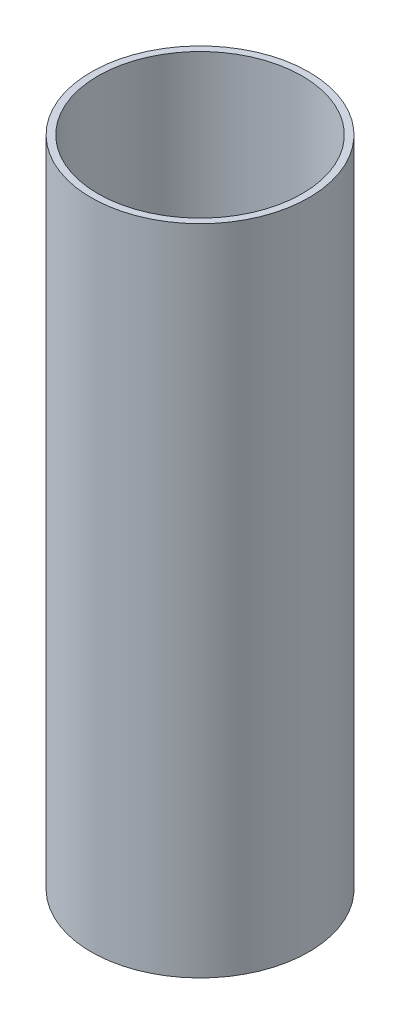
ISO-10303-21;
HEADER;
FILE_DESCRIPTION(('STEP AP214'),'2;1');
FILE_NAME('part.step','',(''),(''),'','','');
FILE_SCHEMA(('AUTOMOTIVE_DESIGN { 1 0 10303 214 1 1 1 1 }'));
ENDSEC;
DATA;
#1=APPLICATION_CONTEXT('core data for automotive mechanical design processes');
#2=APPLICATION_PROTOCOL_DEFINITION('international standard','automotive_design',2000,#1);
#3=PRODUCT_CONTEXT('',#1,'mechanical');
#4=PRODUCT('Part','Part','',(#3));
#5=PRODUCT_RELATED_PRODUCT_CATEGORY('part','',(#4));
#6=PRODUCT_DEFINITION_FORMATION('','',#4);
#7=PRODUCT_DEFINITION_CONTEXT('part definition',#1,'design');
#8=PRODUCT_DEFINITION('design','',#6,#7);
#9=PRODUCT_DEFINITION_SHAPE('','',#8);
#10=(LENGTH_UNIT() NAMED_UNIT(*) SI_UNIT(.MILLI.,.METRE.));
#11=(NAMED_UNIT(*) PLANE_ANGLE_UNIT() SI_UNIT($,.RADIAN.));
#12=(NAMED_UNIT(*) SI_UNIT($,.STERADIAN.) SOLID_ANGLE_UNIT());
#13=UNCERTAINTY_MEASURE_WITH_UNIT(LENGTH_MEASURE(1.E-05),#10,'distance_accuracy_value','');
#14=(GEOMETRIC_REPRESENTATION_CONTEXT(3) GLOBAL_UNCERTAINTY_ASSIGNED_CONTEXT((#13)) GLOBAL_UNIT_ASSIGNED_CONTEXT((#10,
#11,#12)) REPRESENTATION_CONTEXT('',''));
#15=CARTESIAN_POINT('',(0.,0.,0.));
#16=DIRECTION('',(0.,0.,1.));
#17=DIRECTION('',(1.,0.,0.));
#18=AXIS2_PLACEMENT_3D('',#15,#16,#17);
#19=CARTESIAN_POINT('',(0.,152.4,0.));
#20=DIRECTION('',(0.,1.,0.));
#21=DIRECTION('',(0.,0.,1.));
#22=AXIS2_PLACEMENT_3D('',#19,#20,#21);
#23=PLANE('',#22);
#24=CARTESIAN_POINT('',(0.,152.4,0.));
#25=DIRECTION('',(0.,1.,0.));
#26=DIRECTION('',(0.,0.,1.));
#27=AXIS2_PLACEMENT_3D('',#24,#25,#26);
#28=CIRCLE('',#27,25.4);
#29=CARTESIAN_POINT('',(0.,152.4,-25.4));
#30=VERTEX_POINT('',#29);
#31=EDGE_CURVE('E10',#30,#30,#28,.T.);
#32=ORIENTED_EDGE('',*,*,#31,.T.);
#33=EDGE_LOOP('',(#32));
#34=FACE_BOUND('',#33,.T.);
#35=CARTESIAN_POINT('',(0.,152.4,0.));
#36=DIRECTION('',(0.,1.,0.));
#37=DIRECTION('',(0.,0.,1.));
#38=AXIS2_PLACEMENT_3D('',#35,#36,#37);
#39=CIRCLE('',#38,23.8125);
#40=CARTESIAN_POINT('',(0.,152.4,-23.8125));
#41=VERTEX_POINT('',#40);
#42=EDGE_CURVE('E42',#41,#41,#39,.T.);
#43=ORIENTED_EDGE('',*,*,#42,.F.);
#44=EDGE_LOOP('',(#43));
#45=FACE_BOUND('',#44,.T.);
#46=ADVANCED_FACE('F31',(#34,#45),#23,.T.);
#47=CARTESIAN_POINT('',(0.,0.,0.));
#48=DIRECTION('',(0.,1.,0.));
#49=DIRECTION('',(0.,0.,1.));
#50=AXIS2_PLACEMENT_3D('',#47,#48,#49);
#51=PLANE('',#50);
#52=CARTESIAN_POINT('',(0.,0.,0.));
#53=DIRECTION('',(0.,1.,0.));
#54=DIRECTION('',(0.,0.,1.));
#55=AXIS2_PLACEMENT_3D('',#52,#53,#54);
#56=CIRCLE('',#55,25.4);
#57=CARTESIAN_POINT('',(0.,0.,-25.4));
#58=VERTEX_POINT('',#57);
#59=EDGE_CURVE('E35',#58,#58,#56,.T.);
#60=ORIENTED_EDGE('',*,*,#59,.F.);
#61=EDGE_LOOP('',(#60));
#62=FACE_BOUND('',#61,.T.);
#63=CARTESIAN_POINT('',(0.,0.,0.));
#64=DIRECTION('',(0.,1.,0.));
#65=DIRECTION('',(0.,0.,1.));
#66=AXIS2_PLACEMENT_3D('',#63,#64,#65);
#67=CIRCLE('',#66,23.8125);
#68=CARTESIAN_POINT('',(0.,0.,-23.8125));
#69=VERTEX_POINT('',#68);
#70=EDGE_CURVE('E44',#69,#69,#67,.T.);
#71=ORIENTED_EDGE('',*,*,#70,.T.);
#72=EDGE_LOOP('',(#71));
#73=FACE_BOUND('',#72,.T.);
#74=ADVANCED_FACE('F54',(#62,#73),#51,.F.);
#75=CARTESIAN_POINT('',(0.,152.4,0.));
#76=DIRECTION('',(0.,-1.,0.));
#77=DIRECTION('',(0.,0.,-1.));
#78=AXIS2_PLACEMENT_3D('',#75,#76,#77);
#79=CYLINDRICAL_SURFACE('',#78,25.4);
#80=CARTESIAN_POINT('',(0.,152.4,-25.4));
#81=CARTESIAN_POINT('',(0.,150.8125,-25.4));
#82=CARTESIAN_POINT('',(0.,149.225,-25.4));
#83=CARTESIAN_POINT('',(0.,146.05,-25.4));
#84=CARTESIAN_POINT('',(0.,144.4625,-25.4));
#85=CARTESIAN_POINT('',(0.,141.2875,-25.4));
#86=CARTESIAN_POINT('',(0.,139.7,-25.4));
#87=CARTESIAN_POINT('',(0.,136.525,-25.4));
#88=CARTESIAN_POINT('',(0.,134.9375,-25.4));
#89=CARTESIAN_POINT('',(0.,131.7625,-25.4));
#90=CARTESIAN_POINT('',(0.,130.175,-25.4));
#91=CARTESIAN_POINT('',(0.,127.,-25.4));
#92=CARTESIAN_POINT('',(0.,125.4125,-25.4));
#93=CARTESIAN_POINT('',(0.,122.2375,-25.4));
#94=CARTESIAN_POINT('',(0.,120.65,-25.4));
#95=CARTESIAN_POINT('',(0.,117.475,-25.4));
#96=CARTESIAN_POINT('',(0.,115.8875,-25.4));
#97=CARTESIAN_POINT('',(0.,112.7125,-25.4));
#98=CARTESIAN_POINT('',(0.,111.125,-25.4));
#99=CARTESIAN_POINT('',(0.,107.95,-25.4));
#100=CARTESIAN_POINT('',(0.,106.3625,-25.4));
#101=CARTESIAN_POINT('',(0.,103.1875,-25.4));
#102=CARTESIAN_POINT('',(0.,101.6,-25.4));
#103=CARTESIAN_POINT('',(0.,98.425,-25.4));
#104=CARTESIAN_POINT('',(0.,96.8375,-25.4));
#105=CARTESIAN_POINT('',(0.,93.6625,-25.4));
#106=CARTESIAN_POINT('',(0.,92.075,-25.4));
#107=CARTESIAN_POINT('',(0.,88.9,-25.4));
#108=CARTESIAN_POINT('',(0.,87.3125,-25.4));
#109=CARTESIAN_POINT('',(0.,84.1375,-25.4));
#110=CARTESIAN_POINT('',(0.,82.55,-25.4));
#111=CARTESIAN_POINT('',(0.,79.375,-25.4));
#112=CARTESIAN_POINT('',(0.,77.7875,-25.4));
#113=CARTESIAN_POINT('',(0.,74.6125,-25.4));
#114=CARTESIAN_POINT('',(0.,73.025,-25.4));
#115=CARTESIAN_POINT('',(0.,69.85,-25.4));
#116=CARTESIAN_POINT('',(0.,68.2625,-25.4));
#117=CARTESIAN_POINT('',(0.,65.0875,-25.4));
#118=CARTESIAN_POINT('',(0.,63.5,-25.4));
#119=CARTESIAN_POINT('',(0.,60.325,-25.4));
#120=CARTESIAN_POINT('',(0.,58.7375,-25.4));
#121=CARTESIAN_POINT('',(0.,55.5625,-25.4));
#122=CARTESIAN_POINT('',(0.,53.975,-25.4));
#123=CARTESIAN_POINT('',(0.,50.8,-25.4));
#124=CARTESIAN_POINT('',(0.,49.2125,-25.4));
#125=CARTESIAN_POINT('',(0.,46.0375,-25.4));
#126=CARTESIAN_POINT('',(0.,44.45,-25.4));
#127=CARTESIAN_POINT('',(0.,41.275,-25.4));
#128=CARTESIAN_POINT('',(0.,39.6875,-25.4));
#129=CARTESIAN_POINT('',(0.,36.5125,-25.4));
#130=CARTESIAN_POINT('',(0.,34.925,-25.4));
#131=CARTESIAN_POINT('',(0.,31.75,-25.4));
#132=CARTESIAN_POINT('',(0.,30.1625,-25.4));
#133=CARTESIAN_POINT('',(0.,26.9875,-25.4));
#134=CARTESIAN_POINT('',(0.,25.4,-25.4));
#135=CARTESIAN_POINT('',(0.,22.225,-25.4));
#136=CARTESIAN_POINT('',(0.,20.6375,-25.4));
#137=CARTESIAN_POINT('',(0.,17.4625,-25.4));
#138=CARTESIAN_POINT('',(0.,15.875,-25.4));
#139=CARTESIAN_POINT('',(0.,12.7,-25.4));
#140=CARTESIAN_POINT('',(0.,11.1125,-25.4));
#141=CARTESIAN_POINT('',(0.,7.93750000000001,-25.4));
#142=CARTESIAN_POINT('',(0.,6.35,-25.4));
#143=CARTESIAN_POINT('',(0.,3.175,-25.4));
#144=CARTESIAN_POINT('',(0.,1.5875,-25.4));
#145=CARTESIAN_POINT('',(0.,0.,-25.4));
#146=B_SPLINE_CURVE_WITH_KNOTS('',3,(#80,#81,#82,#83,#84,#85,#86,#87,#88,#89,#90,#91,#92,#93,
#94,#95,#96,#97,#98,#99,#100,#101,#102,#103,#104,#105,#106,#107,#108,#109,#110,#111,#112,#113,
#114,#115,#116,#117,#118,#119,#120,#121,#122,#123,#124,#125,#126,#127,#128,#129,#130,#131,#132,
#133,#134,#135,#136,#137,#138,#139,#140,#141,#142,#143,#144,#145),.UNSPECIFIED.,.F.,.F.,(4,2,2,
2,2,2,2,2,2,2,2,2,2,2,2,2,2,2,2,2,2,2,2,2,2,2,2,2,2,2,2,2,4),(0.,4.76249999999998,
9.52499999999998,14.2875,19.05,23.8125,28.575,33.3375,38.1,42.8625,47.625,52.3875,57.15,61.9125,
66.675,71.4375,76.2,80.9625,85.725,90.4875,95.25,100.0125,104.775,109.5375,114.3,119.0625,
123.825,128.5875,133.35,138.1125,142.875,147.6375,152.4),.UNSPECIFIED.);
#147=EDGE_CURVE('BSEAM33',#30,#58,#146,.T.);
#148=ORIENTED_EDGE('',*,*,#31,.F.);
#149=ORIENTED_EDGE('',*,*,#59,.T.);
#150=ORIENTED_EDGE('',*,*,#147,.T.);
#151=ORIENTED_EDGE('',*,*,#147,.F.);
#152=EDGE_LOOP('',(#148,#150,#149,#151));
#153=FACE_BOUND('',#152,.T.);
#154=ADVANCED_FACE('F33',(#153),#79,.T.);
#155=CARTESIAN_POINT('',(0.,152.4,0.));
#156=DIRECTION('',(0.,-1.,0.));
#157=DIRECTION('',(0.,0.,-1.));
#158=AXIS2_PLACEMENT_3D('',#155,#156,#157);
#159=CYLINDRICAL_SURFACE('',#158,23.8125);
#160=CARTESIAN_POINT('',(0.,152.4,-23.8125));
#161=CARTESIAN_POINT('',(0.,150.8125,-23.8125));
#162=CARTESIAN_POINT('',(0.,149.225,-23.8125));
#163=CARTESIAN_POINT('',(0.,146.05,-23.8125));
#164=CARTESIAN_POINT('',(0.,144.4625,-23.8125));
#165=CARTESIAN_POINT('',(0.,141.2875,-23.8125));
#166=CARTESIAN_POINT('',(0.,139.7,-23.8125));
#167=CARTESIAN_POINT('',(0.,136.525,-23.8125));
#168=CARTESIAN_POINT('',(0.,134.9375,-23.8125));
#169=CARTESIAN_POINT('',(0.,131.7625,-23.8125));
#170=CARTESIAN_POINT('',(0.,130.175,-23.8125));
#171=CARTESIAN_POINT('',(0.,127.,-23.8125));
#172=CARTESIAN_POINT('',(0.,125.4125,-23.8125));
#173=CARTESIAN_POINT('',(0.,122.2375,-23.8125));
#174=CARTESIAN_POINT('',(0.,120.65,-23.8125));
#175=CARTESIAN_POINT('',(0.,117.475,-23.8125));
#176=CARTESIAN_POINT('',(0.,115.8875,-23.8125));
#177=CARTESIAN_POINT('',(0.,112.7125,-23.8125));
#178=CARTESIAN_POINT('',(0.,111.125,-23.8125));
#179=CARTESIAN_POINT('',(0.,107.95,-23.8125));
#180=CARTESIAN_POINT('',(0.,106.3625,-23.8125));
#181=CARTESIAN_POINT('',(0.,103.1875,-23.8125));
#182=CARTESIAN_POINT('',(0.,101.6,-23.8125));
#183=CARTESIAN_POINT('',(0.,98.425,-23.8125));
#184=CARTESIAN_POINT('',(0.,96.8375,-23.8125));
#185=CARTESIAN_POINT('',(0.,93.6625,-23.8125));
#186=CARTESIAN_POINT('',(0.,92.075,-23.8125));
#187=CARTESIAN_POINT('',(0.,88.9,-23.8125));
#188=CARTESIAN_POINT('',(0.,87.3125,-23.8125));
#189=CARTESIAN_POINT('',(0.,84.1375,-23.8125));
#190=CARTESIAN_POINT('',(0.,82.55,-23.8125));
#191=CARTESIAN_POINT('',(0.,79.375,-23.8125));
#192=CARTESIAN_POINT('',(0.,77.7875,-23.8125));
#193=CARTESIAN_POINT('',(0.,74.6125,-23.8125));
#194=CARTESIAN_POINT('',(0.,73.025,-23.8125));
#195=CARTESIAN_POINT('',(0.,69.85,-23.8125));
#196=CARTESIAN_POINT('',(0.,68.2625,-23.8125));
#197=CARTESIAN_POINT('',(0.,65.0875,-23.8125));
#198=CARTESIAN_POINT('',(0.,63.5,-23.8125));
#199=CARTESIAN_POINT('',(0.,60.325,-23.8125));
#200=CARTESIAN_POINT('',(0.,58.7375,-23.8125));
#201=CARTESIAN_POINT('',(0.,55.5625,-23.8125));
#202=CARTESIAN_POINT('',(0.,53.975,-23.8125));
#203=CARTESIAN_POINT('',(0.,50.8,-23.8125));
#204=CARTESIAN_POINT('',(0.,49.2125,-23.8125));
#205=CARTESIAN_POINT('',(0.,46.0375,-23.8125));
#206=CARTESIAN_POINT('',(0.,44.45,-23.8125));
#207=CARTESIAN_POINT('',(0.,41.275,-23.8125));
#208=CARTESIAN_POINT('',(0.,39.6875,-23.8125));
#209=CARTESIAN_POINT('',(0.,36.5125,-23.8125));
#210=CARTESIAN_POINT('',(0.,34.925,-23.8125));
#211=CARTESIAN_POINT('',(0.,31.75,-23.8125));
#212=CARTESIAN_POINT('',(0.,30.1625,-23.8125));
#213=CARTESIAN_POINT('',(0.,26.9875,-23.8125));
#214=CARTESIAN_POINT('',(0.,25.4,-23.8125));
#215=CARTESIAN_POINT('',(0.,22.225,-23.8125));
#216=CARTESIAN_POINT('',(0.,20.6375,-23.8125));
#217=CARTESIAN_POINT('',(0.,17.4625,-23.8125));
#218=CARTESIAN_POINT('',(0.,15.875,-23.8125));
#219=CARTESIAN_POINT('',(0.,12.7,-23.8125));
#220=CARTESIAN_POINT('',(0.,11.1125,-23.8125));
#221=CARTESIAN_POINT('',(0.,7.93750000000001,-23.8125));
#222=CARTESIAN_POINT('',(0.,6.35,-23.8125));
#223=CARTESIAN_POINT('',(0.,3.175,-23.8125));
#224=CARTESIAN_POINT('',(0.,1.5875,-23.8125));
#225=CARTESIAN_POINT('',(0.,0.,-23.8125));
#226=B_SPLINE_CURVE_WITH_KNOTS('',3,(#160,#161,#162,#163,#164,#165,#166,#167,#168,#169,#170,
#171,#172,#173,#174,#175,#176,#177,#178,#179,#180,#181,#182,#183,#184,#185,#186,#187,#188,#189,
#190,#191,#192,#193,#194,#195,#196,#197,#198,#199,#200,#201,#202,#203,#204,#205,#206,#207,#208,
#209,#210,#211,#212,#213,#214,#215,#216,#217,#218,#219,#220,#221,#222,#223,#224,#225),
.UNSPECIFIED.,.F.,.F.,(4,2,2,2,2,2,2,2,2,2,2,2,2,2,2,2,2,2,2,2,2,2,2,2,2,2,2,2,2,2,2,2,4),(0.,
4.7625,9.52500000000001,14.2875,19.05,23.8125,28.575,33.3375,38.1,42.8625,47.625,52.3875,57.15,
61.9125,66.675,71.4375,76.2,80.9625,85.725,90.4875,95.25,100.0125,104.775,109.5375,114.3,
119.0625,123.825,128.5875,133.35,138.1125,142.875,147.6375,152.4),.UNSPECIFIED.);
#227=EDGE_CURVE('BSEAM50',#41,#69,#226,.T.);
#228=ORIENTED_EDGE('',*,*,#42,.T.);
#229=ORIENTED_EDGE('',*,*,#70,.F.);
#230=ORIENTED_EDGE('',*,*,#227,.T.);
#231=ORIENTED_EDGE('',*,*,#227,.F.);
#232=EDGE_LOOP('',(#228,#230,#229,#231));
#233=FACE_BOUND('',#232,.T.);
#234=ADVANCED_FACE('F50',(#233),#159,.F.);
#235=CLOSED_SHELL('',(#46,#74,#154,#234));
#236=MANIFOLD_SOLID_BREP('B2',#235);
#237=ADVANCED_BREP_SHAPE_REPRESENTATION('',(#18,#236),#14);
#238=SHAPE_DEFINITION_REPRESENTATION(#9,#237);
ENDSEC;
END-ISO-10303-21;
